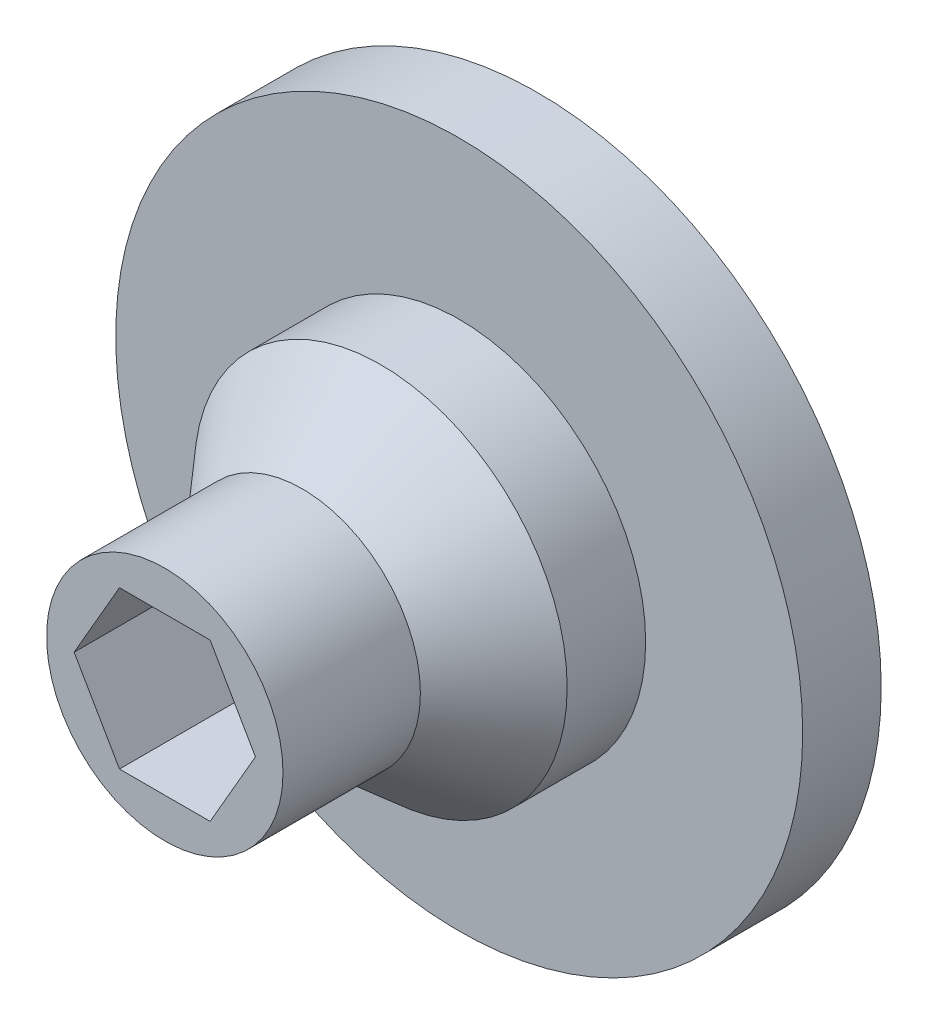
ISO-10303-21;
HEADER;
FILE_DESCRIPTION(('STEP AP214'),'2;1');
FILE_NAME('part.step','',(''),(''),'','','');
FILE_SCHEMA(('AUTOMOTIVE_DESIGN { 1 0 10303 214 1 1 1 1 }'));
ENDSEC;
DATA;
#1=APPLICATION_CONTEXT('core data for automotive mechanical design processes');
#2=APPLICATION_PROTOCOL_DEFINITION('international standard','automotive_design',2000,#1);
#3=PRODUCT_CONTEXT('',#1,'mechanical');
#4=PRODUCT('Part','Part','',(#3));
#5=PRODUCT_RELATED_PRODUCT_CATEGORY('part','',(#4));
#6=PRODUCT_DEFINITION_FORMATION('','',#4);
#7=PRODUCT_DEFINITION_CONTEXT('part definition',#1,'design');
#8=PRODUCT_DEFINITION('design','',#6,#7);
#9=PRODUCT_DEFINITION_SHAPE('','',#8);
#10=(LENGTH_UNIT() NAMED_UNIT(*) SI_UNIT(.MILLI.,.METRE.));
#11=(NAMED_UNIT(*) PLANE_ANGLE_UNIT() SI_UNIT($,.RADIAN.));
#12=(NAMED_UNIT(*) SI_UNIT($,.STERADIAN.) SOLID_ANGLE_UNIT());
#13=UNCERTAINTY_MEASURE_WITH_UNIT(LENGTH_MEASURE(1.E-05),#10,'distance_accuracy_value','');
#14=(GEOMETRIC_REPRESENTATION_CONTEXT(3) GLOBAL_UNCERTAINTY_ASSIGNED_CONTEXT((#13)) GLOBAL_UNIT_ASSIGNED_CONTEXT((#10,
#11,#12)) REPRESENTATION_CONTEXT('',''));
#15=CARTESIAN_POINT('',(0.,0.,0.));
#16=DIRECTION('',(0.,0.,1.));
#17=DIRECTION('',(1.,0.,0.));
#18=AXIS2_PLACEMENT_3D('',#15,#16,#17);
#19=CARTESIAN_POINT('',(0.,0.,0.));
#20=DIRECTION('',(0.,0.,1.));
#21=DIRECTION('',(1.,0.,0.));
#22=AXIS2_PLACEMENT_3D('',#19,#20,#21);
#23=PLANE('',#22);
#24=CARTESIAN_POINT('',(0.,0.,0.));
#25=DIRECTION('',(0.,0.,1.));
#26=DIRECTION('',(1.,0.,0.));
#27=AXIS2_PLACEMENT_3D('',#24,#25,#26);
#28=CIRCLE('',#27,8.75);
#29=CARTESIAN_POINT('',(8.75000000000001,0.,0.));
#30=VERTEX_POINT('',#29);
#31=EDGE_CURVE('E38',#30,#30,#28,.T.);
#32=ORIENTED_EDGE('',*,*,#31,.F.);
#33=EDGE_LOOP('',(#32));
#34=FACE_BOUND('',#33,.T.);
#35=DIRECTION('',(0.499999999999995,0.866025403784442,0.));
#36=VECTOR('',#35,1.);
#37=CARTESIAN_POINT('',(-1.15470053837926,2.,0.));
#38=LINE('',#37,#36);
#39=CARTESIAN_POINT('',(-2.3094010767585,0.,0.));
#40=VERTEX_POINT('',#39);
#41=CARTESIAN_POINT('',(-1.15470053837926,2.,0.));
#42=VERTEX_POINT('',#41);
#43=EDGE_CURVE('E98',#40,#42,#38,.T.);
#44=ORIENTED_EDGE('',*,*,#43,.F.);
#45=DIRECTION('',(-0.500000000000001,0.866025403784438,0.));
#46=VECTOR('',#45,1.);
#47=CARTESIAN_POINT('',(-2.3094010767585,0.,0.));
#48=LINE('',#47,#46);
#49=CARTESIAN_POINT('',(-1.15470053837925,-2.,0.));
#50=VERTEX_POINT('',#49);
#51=EDGE_CURVE('E123',#50,#40,#48,.T.);
#52=ORIENTED_EDGE('',*,*,#51,.F.);
#53=DIRECTION('',(-1.,0.,0.));
#54=VECTOR('',#53,1.);
#55=CARTESIAN_POINT('',(1.15470053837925,-2.00000000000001,0.));
#56=LINE('',#55,#54);
#57=CARTESIAN_POINT('',(1.15470053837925,-2.00000000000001,0.));
#58=VERTEX_POINT('',#57);
#59=EDGE_CURVE('E121',#58,#50,#56,.T.);
#60=ORIENTED_EDGE('',*,*,#59,.F.);
#61=DIRECTION('',(-0.499999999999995,-0.866025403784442,0.));
#62=VECTOR('',#61,1.);
#63=CARTESIAN_POINT('',(1.15470053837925,-2.00000000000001,0.));
#64=LINE('',#63,#62);
#65=CARTESIAN_POINT('',(2.30940107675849,0.,0.));
#66=VERTEX_POINT('',#65);
#67=EDGE_CURVE('E119',#66,#58,#64,.T.);
#68=ORIENTED_EDGE('',*,*,#67,.F.);
#69=DIRECTION('',(0.500000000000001,-0.866025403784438,0.));
#70=VECTOR('',#69,1.);
#71=CARTESIAN_POINT('',(1.15470053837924,1.99999999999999,0.));
#72=LINE('',#71,#70);
#73=CARTESIAN_POINT('',(1.15470053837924,1.99999999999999,0.));
#74=VERTEX_POINT('',#73);
#75=EDGE_CURVE('E117',#74,#66,#72,.T.);
#76=ORIENTED_EDGE('',*,*,#75,.F.);
#77=DIRECTION('',(1.,0.,0.));
#78=VECTOR('',#77,1.);
#79=CARTESIAN_POINT('',(-1.15470053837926,2.,0.));
#80=LINE('',#79,#78);
#81=EDGE_CURVE('E115',#42,#74,#80,.T.);
#82=ORIENTED_EDGE('',*,*,#81,.F.);
#83=EDGE_LOOP('',(#44,#52,#60,#68,#76,#82));
#84=FACE_BOUND('',#83,.T.);
#85=ADVANCED_FACE('F30',(#34,#84),#23,.F.);
#86=CARTESIAN_POINT('',(0.,0.,9.5));
#87=DIRECTION('',(0.,0.,1.));
#88=DIRECTION('',(1.,0.,0.));
#89=AXIS2_PLACEMENT_3D('',#86,#87,#88);
#90=PLANE('',#89);
#91=CARTESIAN_POINT('',(0.,0.,9.5));
#92=DIRECTION('',(0.,0.,1.));
#93=DIRECTION('',(1.,0.,0.));
#94=AXIS2_PLACEMENT_3D('',#91,#92,#93);
#95=CIRCLE('',#94,3.01142652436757);
#96=CARTESIAN_POINT('',(3.01142652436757,0.,9.5));
#97=VERTEX_POINT('',#96);
#98=EDGE_CURVE('E99',#97,#97,#95,.T.);
#99=ORIENTED_EDGE('',*,*,#98,.T.);
#100=EDGE_LOOP('',(#99));
#101=FACE_BOUND('',#100,.T.);
#102=DIRECTION('',(-0.500000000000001,0.866025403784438,0.));
#103=VECTOR('',#102,1.);
#104=CARTESIAN_POINT('',(-2.3094010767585,0.,9.5));
#105=LINE('',#104,#103);
#106=CARTESIAN_POINT('',(-1.15470053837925,-2.,9.5));
#107=VERTEX_POINT('',#106);
#108=CARTESIAN_POINT('',(-2.3094010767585,0.,9.5));
#109=VERTEX_POINT('',#108);
#110=EDGE_CURVE('E104',#107,#109,#105,.T.);
#111=ORIENTED_EDGE('',*,*,#110,.T.);
#112=DIRECTION('',(0.499999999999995,0.866025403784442,0.));
#113=VECTOR('',#112,1.);
#114=CARTESIAN_POINT('',(-1.15470053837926,2.,9.5));
#115=LINE('',#114,#113);
#116=CARTESIAN_POINT('',(-1.15470053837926,2.,9.5));
#117=VERTEX_POINT('',#116);
#118=EDGE_CURVE('E53',#109,#117,#115,.T.);
#119=ORIENTED_EDGE('',*,*,#118,.T.);
#120=DIRECTION('',(1.,0.,0.));
#121=VECTOR('',#120,1.);
#122=CARTESIAN_POINT('',(-1.15470053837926,2.,9.5));
#123=LINE('',#122,#121);
#124=CARTESIAN_POINT('',(1.15470053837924,1.99999999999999,9.5));
#125=VERTEX_POINT('',#124);
#126=EDGE_CURVE('E85',#117,#125,#123,.T.);
#127=ORIENTED_EDGE('',*,*,#126,.T.);
#128=DIRECTION('',(0.500000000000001,-0.866025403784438,0.));
#129=VECTOR('',#128,1.);
#130=CARTESIAN_POINT('',(1.15470053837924,1.99999999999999,9.5));
#131=LINE('',#130,#129);
#132=CARTESIAN_POINT('',(2.30940107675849,0.,9.5));
#133=VERTEX_POINT('',#132);
#134=EDGE_CURVE('E94',#125,#133,#131,.T.);
#135=ORIENTED_EDGE('',*,*,#134,.T.);
#136=DIRECTION('',(-0.499999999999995,-0.866025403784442,0.));
#137=VECTOR('',#136,1.);
#138=CARTESIAN_POINT('',(1.15470053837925,-2.00000000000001,9.5));
#139=LINE('',#138,#137);
#140=CARTESIAN_POINT('',(1.15470053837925,-2.00000000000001,9.5));
#141=VERTEX_POINT('',#140);
#142=EDGE_CURVE('E108',#133,#141,#139,.T.);
#143=ORIENTED_EDGE('',*,*,#142,.T.);
#144=DIRECTION('',(-1.,0.,0.));
#145=VECTOR('',#144,1.);
#146=CARTESIAN_POINT('',(1.15470053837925,-2.00000000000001,9.5));
#147=LINE('',#146,#145);
#148=EDGE_CURVE('E111',#141,#107,#147,.T.);
#149=ORIENTED_EDGE('',*,*,#148,.T.);
#150=EDGE_LOOP('',(#111,#119,#127,#135,#143,#149));
#151=FACE_BOUND('',#150,.T.);
#152=ADVANCED_FACE('F102',(#101,#151),#90,.T.);
#153=CARTESIAN_POINT('',(0.,0.,2.));
#154=DIRECTION('',(0.,0.,1.));
#155=DIRECTION('',(1.,0.,0.));
#156=AXIS2_PLACEMENT_3D('',#153,#154,#155);
#157=PLANE('',#156);
#158=CARTESIAN_POINT('',(0.,0.,2.));
#159=DIRECTION('',(0.,0.,1.));
#160=DIRECTION('',(1.,0.,0.));
#161=AXIS2_PLACEMENT_3D('',#158,#159,#160);
#162=CIRCLE('',#161,8.75);
#163=CARTESIAN_POINT('',(8.75000000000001,0.,2.));
#164=VERTEX_POINT('',#163);
#165=EDGE_CURVE('E11',#164,#164,#162,.T.);
#166=ORIENTED_EDGE('',*,*,#165,.T.);
#167=EDGE_LOOP('',(#166));
#168=FACE_BOUND('',#167,.T.);
#169=CARTESIAN_POINT('',(0.,0.,2.));
#170=DIRECTION('',(0.,0.,1.));
#171=DIRECTION('',(1.,0.,0.));
#172=AXIS2_PLACEMENT_3D('',#169,#170,#171);
#173=CIRCLE('',#172,4.75000000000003);
#174=CARTESIAN_POINT('',(4.75000000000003,0.,2.));
#175=VERTEX_POINT('',#174);
#176=EDGE_CURVE('E138',#175,#175,#173,.T.);
#177=ORIENTED_EDGE('',*,*,#176,.F.);
#178=EDGE_LOOP('',(#177));
#179=FACE_BOUND('',#178,.T.);
#180=ADVANCED_FACE('F183',(#168,#179),#157,.T.);
#181=CARTESIAN_POINT('',(0.,0.,2.));
#182=DIRECTION('',(0.,0.,-1.));
#183=DIRECTION('',(-1.,0.,0.));
#184=AXIS2_PLACEMENT_3D('',#181,#182,#183);
#185=CYLINDRICAL_SURFACE('',#184,8.75);
#186=ORIENTED_EDGE('',*,*,#165,.F.);
#187=EDGE_LOOP('',(#186));
#188=FACE_BOUND('',#187,.T.);
#189=ORIENTED_EDGE('',*,*,#31,.T.);
#190=EDGE_LOOP('',(#189));
#191=FACE_BOUND('',#190,.T.);
#192=ADVANCED_FACE('F32',(#188,#191),#185,.T.);
#193=CARTESIAN_POINT('',(0.,0.,4.));
#194=DIRECTION('',(0.,0.,-1.));
#195=DIRECTION('',(-1.,0.,0.));
#196=AXIS2_PLACEMENT_3D('',#193,#194,#195);
#197=CYLINDRICAL_SURFACE('',#196,4.75000000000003);
#198=CARTESIAN_POINT('',(0.,0.,4.));
#199=DIRECTION('',(0.,0.,1.));
#200=DIRECTION('',(1.,0.,0.));
#201=AXIS2_PLACEMENT_3D('',#198,#199,#200);
#202=CIRCLE('',#201,4.75000000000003);
#203=CARTESIAN_POINT('',(4.75000000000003,0.,4.));
#204=VERTEX_POINT('',#203);
#205=EDGE_CURVE('E141',#204,#204,#202,.T.);
#206=ORIENTED_EDGE('',*,*,#205,.F.);
#207=EDGE_LOOP('',(#206));
#208=FACE_BOUND('',#207,.T.);
#209=ORIENTED_EDGE('',*,*,#176,.T.);
#210=EDGE_LOOP('',(#209));
#211=FACE_BOUND('',#210,.T.);
#212=ADVANCED_FACE('F191',(#208,#211),#197,.T.);
#213=CARTESIAN_POINT('',(0.,0.,4.));
#214=DIRECTION('',(0.,0.,-1.));
#215=DIRECTION('',(1.,0.,0.));
#216=AXIS2_PLACEMENT_3D('',#213,#214,#215);
#217=CONICAL_SURFACE('',#216,4.75000000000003,0.715584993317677);
#218=CARTESIAN_POINT('',(0.,0.,6.));
#219=DIRECTION('',(0.,0.,1.));
#220=DIRECTION('',(1.,0.,0.));
#221=AXIS2_PLACEMENT_3D('',#218,#219,#220);
#222=CIRCLE('',#221,3.01142652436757);
#223=CARTESIAN_POINT('',(3.01142652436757,0.,6.));
#224=VERTEX_POINT('',#223);
#225=EDGE_CURVE('E135',#224,#224,#222,.T.);
#226=ORIENTED_EDGE('',*,*,#225,.F.);
#227=EDGE_LOOP('',(#226));
#228=FACE_BOUND('',#227,.T.);
#229=ORIENTED_EDGE('',*,*,#205,.T.);
#230=EDGE_LOOP('',(#229));
#231=FACE_BOUND('',#230,.T.);
#232=ADVANCED_FACE('F187',(#228,#231),#217,.T.);
#233=CARTESIAN_POINT('',(0.,0.,9.5));
#234=DIRECTION('',(0.,0.,-1.));
#235=DIRECTION('',(-1.,0.,0.));
#236=AXIS2_PLACEMENT_3D('',#233,#234,#235);
#237=CYLINDRICAL_SURFACE('',#236,3.01142652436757);
#238=ORIENTED_EDGE('',*,*,#98,.F.);
#239=EDGE_LOOP('',(#238));
#240=FACE_BOUND('',#239,.T.);
#241=ORIENTED_EDGE('',*,*,#225,.T.);
#242=EDGE_LOOP('',(#241));
#243=FACE_BOUND('',#242,.T.);
#244=ADVANCED_FACE('F180',(#240,#243),#237,.T.);
#245=CARTESIAN_POINT('',(-1.15470053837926,2.,0.));
#246=DIRECTION('',(0.866025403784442,-0.499999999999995,0.));
#247=DIRECTION('',(0.499999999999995,0.866025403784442,0.));
#248=AXIS2_PLACEMENT_3D('',#245,#246,#247);
#249=PLANE('',#248);
#250=ORIENTED_EDGE('',*,*,#118,.F.);
#251=DIRECTION('',(0.,0.,1.));
#252=VECTOR('',#251,1.);
#253=CARTESIAN_POINT('',(-2.3094010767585,0.,0.));
#254=LINE('',#253,#252);
#255=EDGE_CURVE('E125',#40,#109,#254,.T.);
#256=ORIENTED_EDGE('',*,*,#255,.F.);
#257=ORIENTED_EDGE('',*,*,#43,.T.);
#258=DIRECTION('',(0.,0.,1.));
#259=VECTOR('',#258,1.);
#260=CARTESIAN_POINT('',(-1.15470053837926,2.,0.));
#261=LINE('',#260,#259);
#262=EDGE_CURVE('E87',#42,#117,#261,.T.);
#263=ORIENTED_EDGE('',*,*,#262,.T.);
#264=EDGE_LOOP('',(#250,#256,#257,#263));
#265=FACE_BOUND('',#264,.T.);
#266=ADVANCED_FACE('F96',(#265),#249,.T.);
#267=CARTESIAN_POINT('',(-1.15470053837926,2.,0.));
#268=DIRECTION('',(0.,-1.,0.));
#269=DIRECTION('',(1.,0.,0.));
#270=AXIS2_PLACEMENT_3D('',#267,#268,#269);
#271=PLANE('',#270);
#272=ORIENTED_EDGE('',*,*,#126,.F.);
#273=ORIENTED_EDGE('',*,*,#262,.F.);
#274=ORIENTED_EDGE('',*,*,#81,.T.);
#275=DIRECTION('',(0.,0.,1.));
#276=VECTOR('',#275,1.);
#277=CARTESIAN_POINT('',(1.15470053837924,1.99999999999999,0.));
#278=LINE('',#277,#276);
#279=EDGE_CURVE('E90',#74,#125,#278,.T.);
#280=ORIENTED_EDGE('',*,*,#279,.T.);
#281=EDGE_LOOP('',(#272,#273,#274,#280));
#282=FACE_BOUND('',#281,.T.);
#283=ADVANCED_FACE('F86',(#282),#271,.T.);
#284=CARTESIAN_POINT('',(1.15470053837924,1.99999999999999,0.));
#285=DIRECTION('',(-0.866025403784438,-0.500000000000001,0.));
#286=DIRECTION('',(0.500000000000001,-0.866025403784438,0.));
#287=AXIS2_PLACEMENT_3D('',#284,#285,#286);
#288=PLANE('',#287);
#289=ORIENTED_EDGE('',*,*,#134,.F.);
#290=ORIENTED_EDGE('',*,*,#279,.F.);
#291=ORIENTED_EDGE('',*,*,#75,.T.);
#292=DIRECTION('',(0.,0.,1.));
#293=VECTOR('',#292,1.);
#294=CARTESIAN_POINT('',(2.30940107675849,0.,0.));
#295=LINE('',#294,#293);
#296=EDGE_CURVE('E130',#66,#133,#295,.T.);
#297=ORIENTED_EDGE('',*,*,#296,.T.);
#298=EDGE_LOOP('',(#289,#290,#291,#297));
#299=FACE_BOUND('',#298,.T.);
#300=ADVANCED_FACE('F155',(#299),#288,.T.);
#301=CARTESIAN_POINT('',(1.15470053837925,-2.00000000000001,0.));
#302=DIRECTION('',(-0.866025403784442,0.499999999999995,0.));
#303=DIRECTION('',(-0.499999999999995,-0.866025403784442,0.));
#304=AXIS2_PLACEMENT_3D('',#301,#302,#303);
#305=PLANE('',#304);
#306=ORIENTED_EDGE('',*,*,#142,.F.);
#307=ORIENTED_EDGE('',*,*,#296,.F.);
#308=ORIENTED_EDGE('',*,*,#67,.T.);
#309=DIRECTION('',(0.,0.,1.));
#310=VECTOR('',#309,1.);
#311=CARTESIAN_POINT('',(1.15470053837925,-2.00000000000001,0.));
#312=LINE('',#311,#310);
#313=EDGE_CURVE('E128',#58,#141,#312,.T.);
#314=ORIENTED_EDGE('',*,*,#313,.T.);
#315=EDGE_LOOP('',(#306,#307,#308,#314));
#316=FACE_BOUND('',#315,.T.);
#317=ADVANCED_FACE('F160',(#316),#305,.T.);
#318=CARTESIAN_POINT('',(1.15470053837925,-2.00000000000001,0.));
#319=DIRECTION('',(0.,1.,0.));
#320=DIRECTION('',(-1.,0.,0.));
#321=AXIS2_PLACEMENT_3D('',#318,#319,#320);
#322=PLANE('',#321);
#323=ORIENTED_EDGE('',*,*,#148,.F.);
#324=ORIENTED_EDGE('',*,*,#313,.F.);
#325=ORIENTED_EDGE('',*,*,#59,.T.);
#326=DIRECTION('',(0.,0.,1.));
#327=VECTOR('',#326,1.);
#328=CARTESIAN_POINT('',(-1.15470053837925,-2.,0.));
#329=LINE('',#328,#327);
#330=EDGE_CURVE('E45',#50,#107,#329,.T.);
#331=ORIENTED_EDGE('',*,*,#330,.T.);
#332=EDGE_LOOP('',(#323,#324,#325,#331));
#333=FACE_BOUND('',#332,.T.);
#334=ADVANCED_FACE('F163',(#333),#322,.T.);
#335=CARTESIAN_POINT('',(-2.3094010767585,0.,0.));
#336=DIRECTION('',(0.866025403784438,0.500000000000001,0.));
#337=DIRECTION('',(-0.500000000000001,0.866025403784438,0.));
#338=AXIS2_PLACEMENT_3D('',#335,#336,#337);
#339=PLANE('',#338);
#340=ORIENTED_EDGE('',*,*,#110,.F.);
#341=ORIENTED_EDGE('',*,*,#330,.F.);
#342=ORIENTED_EDGE('',*,*,#51,.T.);
#343=ORIENTED_EDGE('',*,*,#255,.T.);
#344=EDGE_LOOP('',(#340,#341,#342,#343));
#345=FACE_BOUND('',#344,.T.);
#346=ADVANCED_FACE('F164',(#345),#339,.T.);
#347=CLOSED_SHELL('',(#85,#152,#180,#192,#212,#232,#244,#266,#283,#300,#317,#334,#346));
#348=MANIFOLD_SOLID_BREP('B2',#347);
#349=ADVANCED_BREP_SHAPE_REPRESENTATION('',(#18,#348),#14);
#350=SHAPE_DEFINITION_REPRESENTATION(#9,#349);
ENDSEC;
END-ISO-10303-21;
